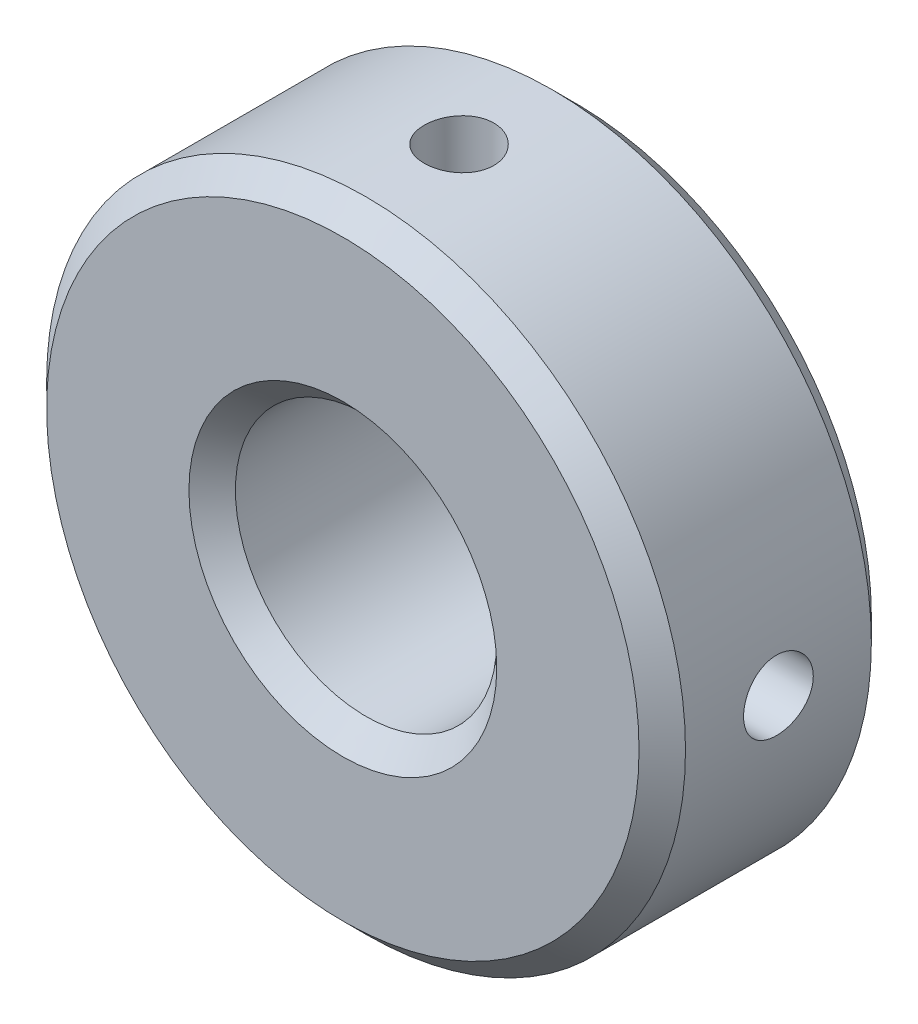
from build123d import *

# Parameters (mm, degrees)
SKETCH1_R         = 11
SKETCH1_R_2       = 4.5
BASENUT_DEPTH     = 4
CIRPATTERN1_COUNT = 4
CHAMFER1_SIZE     = 0.8


with BuildPart() as part:
    # Sketch1 → BaseNut (new, symmetric)
    with BuildSketch(Plane.XY):
        Circle(SKETCH1_R)
        Circle(SKETCH1_R_2, mode=Mode.SUBTRACT)
    extrude(amount=BASENUT_DEPTH, both=True)

    # Sketch2 → Cut-Revolve2 (revolve, cut)
    with BuildSketch(Plane.XY, mode=Mode.PRIVATE) as cut_revolve2_sk:
        Polygon((0, 11), (1.2001011, 11), (1.2001011, 7.61054178), (0, 6.917663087), align=None)
    cut_revolve2 = revolve(cut_revolve2_sk.sketch.rotate(Axis((0, 14.609026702, 0), (0, -1, 0)), 90), axis=Axis((0, 14.609026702, 0), (0, -1, 0)), mode=Mode.SUBTRACT)

    # CirPattern1: Cut-Revolve2 ×4 about axis
    cirpattern1_axis = Axis((0, 0, -4), (0, 0, 1))
    for i in range(1, CIRPATTERN1_COUNT):
        add(cut_revolve2.rotate(cirpattern1_axis, i * 360 / CIRPATTERN1_COUNT), mode=Mode.SUBTRACT)

    # Chamfer1
    chamfer1_edges = [part.edges().sort_by_distance(p)[0] for p in [
        (-11, 0, 4),
        (-11, 0, -4),
        (-4.5, 0, -4),
        (-4.5, 0, 4),
    ]]
    chamfer(chamfer1_edges, length=CHAMFER1_SIZE)


solid = part.part
